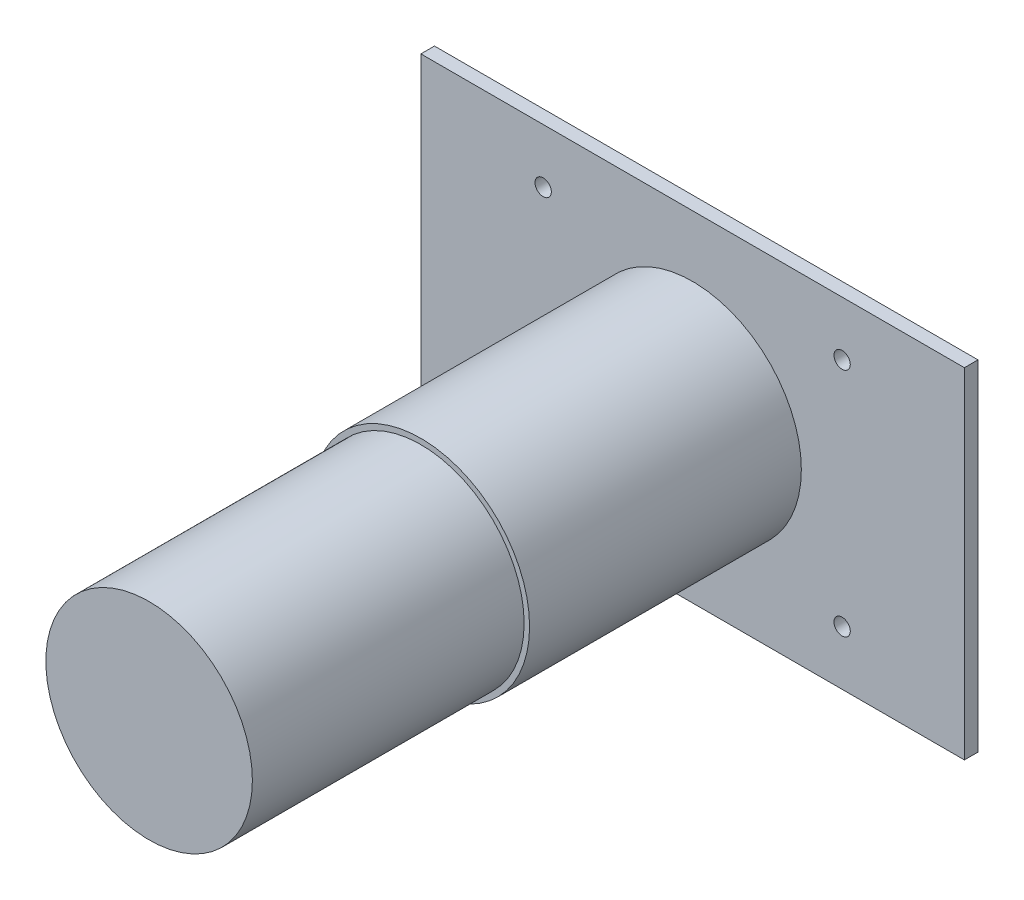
ISO-10303-21;
HEADER;
FILE_DESCRIPTION(('STEP AP214'),'2;1');
FILE_NAME('part.step','',(''),(''),'','','');
FILE_SCHEMA(('AUTOMOTIVE_DESIGN { 1 0 10303 214 1 1 1 1 }'));
ENDSEC;
DATA;
#1=APPLICATION_CONTEXT('core data for automotive mechanical design processes');
#2=APPLICATION_PROTOCOL_DEFINITION('international standard','automotive_design',2000,#1);
#3=PRODUCT_CONTEXT('',#1,'mechanical');
#4=PRODUCT('Part','Part','',(#3));
#5=PRODUCT_RELATED_PRODUCT_CATEGORY('part','',(#4));
#6=PRODUCT_DEFINITION_FORMATION('','',#4);
#7=PRODUCT_DEFINITION_CONTEXT('part definition',#1,'design');
#8=PRODUCT_DEFINITION('design','',#6,#7);
#9=PRODUCT_DEFINITION_SHAPE('','',#8);
#10=(LENGTH_UNIT() NAMED_UNIT(*) SI_UNIT(.MILLI.,.METRE.));
#11=(NAMED_UNIT(*) PLANE_ANGLE_UNIT() SI_UNIT($,.RADIAN.));
#12=(NAMED_UNIT(*) SI_UNIT($,.STERADIAN.) SOLID_ANGLE_UNIT());
#13=UNCERTAINTY_MEASURE_WITH_UNIT(LENGTH_MEASURE(1.E-05),#10,'distance_accuracy_value','');
#14=(GEOMETRIC_REPRESENTATION_CONTEXT(3) GLOBAL_UNCERTAINTY_ASSIGNED_CONTEXT((#13)) GLOBAL_UNIT_ASSIGNED_CONTEXT((#10,
#11,#12)) REPRESENTATION_CONTEXT('',''));
#15=CARTESIAN_POINT('',(0.,0.,0.));
#16=DIRECTION('',(0.,0.,1.));
#17=DIRECTION('',(1.,0.,0.));
#18=AXIS2_PLACEMENT_3D('',#15,#16,#17);
#19=CARTESIAN_POINT('',(-2.64051219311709,-5.7819383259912,205.));
#20=DIRECTION('',(0.,0.,-1.));
#21=DIRECTION('',(-1.,0.,0.));
#22=AXIS2_PLACEMENT_3D('',#19,#20,#21);
#23=CYLINDRICAL_SURFACE('',#22,40.);
#24=CARTESIAN_POINT('',(-2.64051219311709,-5.7819383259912,5.));
#25=DIRECTION('',(0.,0.,1.));
#26=DIRECTION('',(1.,0.,0.));
#27=AXIS2_PLACEMENT_3D('',#24,#25,#26);
#28=CIRCLE('',#27,40.);
#29=CARTESIAN_POINT('',(37.3594878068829,-5.7819383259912,5.));
#30=VERTEX_POINT('',#29);
#31=EDGE_CURVE('E105',#30,#30,#28,.T.);
#32=ORIENTED_EDGE('',*,*,#31,.T.);
#33=EDGE_LOOP('',(#32));
#34=FACE_BOUND('',#33,.T.);
#35=CARTESIAN_POINT('',(-2.64051219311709,-5.7819383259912,105.));
#36=DIRECTION('',(0.,0.,1.));
#37=DIRECTION('',(1.,0.,0.));
#38=AXIS2_PLACEMENT_3D('',#35,#36,#37);
#39=CIRCLE('',#38,40.);
#40=CARTESIAN_POINT('',(37.3594878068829,-5.7819383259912,105.));
#41=VERTEX_POINT('',#40);
#42=EDGE_CURVE('E208',#41,#41,#39,.T.);
#43=ORIENTED_EDGE('',*,*,#42,.F.);
#44=EDGE_LOOP('',(#43));
#45=FACE_BOUND('',#44,.T.);
#46=ADVANCED_FACE('F34',(#34,#45),#23,.T.);
#47=CARTESIAN_POINT('',(-102.640512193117,56.7180616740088,5.));
#48=DIRECTION('',(1.,0.,0.));
#49=DIRECTION('',(0.,0.,-1.));
#50=AXIS2_PLACEMENT_3D('',#47,#48,#49);
#51=PLANE('',#50);
#52=DIRECTION('',(0.,-1.,0.));
#53=VECTOR('',#52,1.);
#54=CARTESIAN_POINT('',(-102.640512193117,56.7180616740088,0.));
#55=LINE('',#54,#53);
#56=CARTESIAN_POINT('',(-102.640512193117,56.7180616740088,0.));
#57=VERTEX_POINT('',#56);
#58=CARTESIAN_POINT('',(-102.640512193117,-68.2819383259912,0.));
#59=VERTEX_POINT('',#58);
#60=EDGE_CURVE('E102',#57,#59,#55,.T.);
#61=ORIENTED_EDGE('',*,*,#60,.T.);
#62=DIRECTION('',(0.,0.,-1.));
#63=VECTOR('',#62,1.);
#64=CARTESIAN_POINT('',(-102.640512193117,-68.2819383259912,5.));
#65=LINE('',#64,#63);
#66=CARTESIAN_POINT('',(-102.640512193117,-68.2819383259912,5.));
#67=VERTEX_POINT('',#66);
#68=EDGE_CURVE('E44',#67,#59,#65,.T.);
#69=ORIENTED_EDGE('',*,*,#68,.F.);
#70=DIRECTION('',(0.,-1.,0.));
#71=VECTOR('',#70,1.);
#72=CARTESIAN_POINT('',(-102.640512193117,56.7180616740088,5.));
#73=LINE('',#72,#71);
#74=CARTESIAN_POINT('',(-102.640512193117,56.7180616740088,5.));
#75=VERTEX_POINT('',#74);
#76=EDGE_CURVE('E88',#75,#67,#73,.T.);
#77=ORIENTED_EDGE('',*,*,#76,.F.);
#78=DIRECTION('',(0.,0.,-1.));
#79=VECTOR('',#78,1.);
#80=CARTESIAN_POINT('',(-102.640512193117,56.7180616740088,5.));
#81=LINE('',#80,#79);
#82=EDGE_CURVE('E98',#75,#57,#81,.T.);
#83=ORIENTED_EDGE('',*,*,#82,.T.);
#84=EDGE_LOOP('',(#61,#69,#77,#83));
#85=FACE_BOUND('',#84,.T.);
#86=ADVANCED_FACE('F36',(#85),#51,.F.);
#87=CARTESIAN_POINT('',(-102.640512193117,-68.2819383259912,5.));
#88=DIRECTION('',(0.,1.,0.));
#89=DIRECTION('',(-1.,0.,0.));
#90=AXIS2_PLACEMENT_3D('',#87,#88,#89);
#91=PLANE('',#90);
#92=DIRECTION('',(1.,0.,0.));
#93=VECTOR('',#92,1.);
#94=CARTESIAN_POINT('',(-102.640512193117,-68.2819383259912,0.));
#95=LINE('',#94,#93);
#96=CARTESIAN_POINT('',(97.3594878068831,-68.2819383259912,0.));
#97=VERTEX_POINT('',#96);
#98=EDGE_CURVE('E93',#59,#97,#95,.T.);
#99=ORIENTED_EDGE('',*,*,#98,.T.);
#100=DIRECTION('',(0.,0.,-1.));
#101=VECTOR('',#100,1.);
#102=CARTESIAN_POINT('',(97.3594878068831,-68.2819383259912,5.));
#103=LINE('',#102,#101);
#104=CARTESIAN_POINT('',(97.3594878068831,-68.2819383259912,5.));
#105=VERTEX_POINT('',#104);
#106=EDGE_CURVE('E91',#105,#97,#103,.T.);
#107=ORIENTED_EDGE('',*,*,#106,.F.);
#108=DIRECTION('',(1.,0.,0.));
#109=VECTOR('',#108,1.);
#110=CARTESIAN_POINT('',(-102.640512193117,-68.2819383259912,5.));
#111=LINE('',#110,#109);
#112=EDGE_CURVE('E83',#67,#105,#111,.T.);
#113=ORIENTED_EDGE('',*,*,#112,.F.);
#114=ORIENTED_EDGE('',*,*,#68,.T.);
#115=EDGE_LOOP('',(#99,#107,#113,#114));
#116=FACE_BOUND('',#115,.T.);
#117=ADVANCED_FACE('F92',(#116),#91,.F.);
#118=CARTESIAN_POINT('',(97.3594878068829,56.7180616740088,5.));
#119=DIRECTION('',(-1.,0.,0.));
#120=DIRECTION('',(0.,-1.,0.));
#121=AXIS2_PLACEMENT_3D('',#118,#119,#120);
#122=PLANE('',#121);
#123=DIRECTION('',(0.,1.,0.));
#124=VECTOR('',#123,1.);
#125=CARTESIAN_POINT('',(97.3594878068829,56.7180616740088,0.));
#126=LINE('',#125,#124);
#127=CARTESIAN_POINT('',(97.3594878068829,56.7180616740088,0.));
#128=VERTEX_POINT('',#127);
#129=EDGE_CURVE('E69',#97,#128,#126,.T.);
#130=ORIENTED_EDGE('',*,*,#129,.T.);
#131=DIRECTION('',(0.,0.,-1.));
#132=VECTOR('',#131,1.);
#133=CARTESIAN_POINT('',(97.3594878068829,56.7180616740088,5.));
#134=LINE('',#133,#132);
#135=CARTESIAN_POINT('',(97.3594878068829,56.7180616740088,5.));
#136=VERTEX_POINT('',#135);
#137=EDGE_CURVE('E94',#136,#128,#134,.T.);
#138=ORIENTED_EDGE('',*,*,#137,.F.);
#139=DIRECTION('',(0.,1.,0.));
#140=VECTOR('',#139,1.);
#141=CARTESIAN_POINT('',(97.3594878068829,56.7180616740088,5.));
#142=LINE('',#141,#140);
#143=EDGE_CURVE('E86',#105,#136,#142,.T.);
#144=ORIENTED_EDGE('',*,*,#143,.F.);
#145=ORIENTED_EDGE('',*,*,#106,.T.);
#146=EDGE_LOOP('',(#130,#138,#144,#145));
#147=FACE_BOUND('',#146,.T.);
#148=ADVANCED_FACE('F96',(#147),#122,.F.);
#149=CARTESIAN_POINT('',(-102.640512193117,56.7180616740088,5.));
#150=DIRECTION('',(0.,-1.,0.));
#151=DIRECTION('',(0.,0.,-1.));
#152=AXIS2_PLACEMENT_3D('',#149,#150,#151);
#153=PLANE('',#152);
#154=DIRECTION('',(-1.,0.,0.));
#155=VECTOR('',#154,1.);
#156=CARTESIAN_POINT('',(-102.640512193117,56.7180616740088,0.));
#157=LINE('',#156,#155);
#158=EDGE_CURVE('E75',#128,#57,#157,.T.);
#159=ORIENTED_EDGE('',*,*,#158,.T.);
#160=ORIENTED_EDGE('',*,*,#82,.F.);
#161=DIRECTION('',(-1.,0.,0.));
#162=VECTOR('',#161,1.);
#163=CARTESIAN_POINT('',(-102.640512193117,56.7180616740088,5.));
#164=LINE('',#163,#162);
#165=EDGE_CURVE('E52',#136,#75,#164,.T.);
#166=ORIENTED_EDGE('',*,*,#165,.F.);
#167=ORIENTED_EDGE('',*,*,#137,.T.);
#168=EDGE_LOOP('',(#159,#160,#166,#167));
#169=FACE_BOUND('',#168,.T.);
#170=ADVANCED_FACE('F125',(#169),#153,.F.);
#171=CARTESIAN_POINT('',(0.,0.,5.));
#172=DIRECTION('',(0.,0.,1.));
#173=DIRECTION('',(1.,0.,0.));
#174=AXIS2_PLACEMENT_3D('',#171,#172,#173);
#175=PLANE('',#174);
#176=CARTESIAN_POINT('',(52.3594878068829,36.7180616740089,5.));
#177=DIRECTION('',(0.,0.,1.));
#178=DIRECTION('',(-1.,0.,0.));
#179=AXIS2_PLACEMENT_3D('',#176,#177,#178);
#180=CIRCLE('',#179,3.);
#181=CARTESIAN_POINT('',(49.3594878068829,36.7180616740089,5.));
#182=VERTEX_POINT('',#181);
#183=EDGE_CURVE('E179',#182,#182,#180,.T.);
#184=ORIENTED_EDGE('',*,*,#183,.F.);
#185=EDGE_LOOP('',(#184));
#186=FACE_BOUND('',#185,.T.);
#187=CARTESIAN_POINT('',(52.359487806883,-48.2819383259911,5.));
#188=DIRECTION('',(0.,0.,-1.));
#189=DIRECTION('',(-1.,0.,0.));
#190=AXIS2_PLACEMENT_3D('',#187,#188,#189);
#191=CIRCLE('',#190,3.);
#192=CARTESIAN_POINT('',(49.359487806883,-48.2819383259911,5.));
#193=VERTEX_POINT('',#192);
#194=EDGE_CURVE('E181',#193,#193,#191,.T.);
#195=ORIENTED_EDGE('',*,*,#194,.T.);
#196=EDGE_LOOP('',(#195));
#197=FACE_BOUND('',#196,.T.);
#198=CARTESIAN_POINT('',(-57.6405121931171,36.7180616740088,5.));
#199=DIRECTION('',(0.,0.,-1.));
#200=DIRECTION('',(1.,0.,0.));
#201=AXIS2_PLACEMENT_3D('',#198,#199,#200);
#202=CIRCLE('',#201,3.);
#203=CARTESIAN_POINT('',(-54.6405121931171,36.7180616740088,5.));
#204=VERTEX_POINT('',#203);
#205=EDGE_CURVE('E187',#204,#204,#202,.T.);
#206=ORIENTED_EDGE('',*,*,#205,.T.);
#207=EDGE_LOOP('',(#206));
#208=FACE_BOUND('',#207,.T.);
#209=CARTESIAN_POINT('',(-57.6405121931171,-48.2819383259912,5.));
#210=DIRECTION('',(0.,0.,1.));
#211=DIRECTION('',(1.,0.,0.));
#212=AXIS2_PLACEMENT_3D('',#209,#210,#211);
#213=CIRCLE('',#212,3.);
#214=CARTESIAN_POINT('',(-54.6405121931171,-48.2819383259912,5.));
#215=VERTEX_POINT('',#214);
#216=EDGE_CURVE('E193',#215,#215,#213,.T.);
#217=ORIENTED_EDGE('',*,*,#216,.F.);
#218=EDGE_LOOP('',(#217));
#219=FACE_BOUND('',#218,.T.);
#220=ORIENTED_EDGE('',*,*,#31,.F.);
#221=EDGE_LOOP('',(#220));
#222=FACE_BOUND('',#221,.T.);
#223=ORIENTED_EDGE('',*,*,#76,.T.);
#224=ORIENTED_EDGE('',*,*,#112,.T.);
#225=ORIENTED_EDGE('',*,*,#143,.T.);
#226=ORIENTED_EDGE('',*,*,#165,.T.);
#227=EDGE_LOOP('',(#223,#224,#225,#226));
#228=FACE_BOUND('',#227,.T.);
#229=ADVANCED_FACE('F84',(#186,#197,#208,#219,#222,#228),#175,.T.);
#230=CARTESIAN_POINT('',(0.,0.,0.));
#231=DIRECTION('',(0.,0.,1.));
#232=DIRECTION('',(1.,0.,0.));
#233=AXIS2_PLACEMENT_3D('',#230,#231,#232);
#234=PLANE('',#233);
#235=CARTESIAN_POINT('',(52.3594878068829,36.7180616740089,0.));
#236=DIRECTION('',(0.,0.,1.));
#237=DIRECTION('',(-1.,0.,0.));
#238=AXIS2_PLACEMENT_3D('',#235,#236,#237);
#239=CIRCLE('',#238,3.);
#240=CARTESIAN_POINT('',(49.3594878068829,36.7180616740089,0.));
#241=VERTEX_POINT('',#240);
#242=EDGE_CURVE('E176',#241,#241,#239,.T.);
#243=ORIENTED_EDGE('',*,*,#242,.T.);
#244=EDGE_LOOP('',(#243));
#245=FACE_BOUND('',#244,.T.);
#246=CARTESIAN_POINT('',(52.359487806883,-48.2819383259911,0.));
#247=DIRECTION('',(0.,0.,-1.));
#248=DIRECTION('',(-1.,0.,0.));
#249=AXIS2_PLACEMENT_3D('',#246,#247,#248);
#250=CIRCLE('',#249,3.);
#251=CARTESIAN_POINT('',(49.359487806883,-48.2819383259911,0.));
#252=VERTEX_POINT('',#251);
#253=EDGE_CURVE('E184',#252,#252,#250,.T.);
#254=ORIENTED_EDGE('',*,*,#253,.F.);
#255=EDGE_LOOP('',(#254));
#256=FACE_BOUND('',#255,.T.);
#257=CARTESIAN_POINT('',(-57.6405121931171,36.7180616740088,0.));
#258=DIRECTION('',(0.,0.,-1.));
#259=DIRECTION('',(1.,0.,0.));
#260=AXIS2_PLACEMENT_3D('',#257,#258,#259);
#261=CIRCLE('',#260,3.);
#262=CARTESIAN_POINT('',(-54.6405121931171,36.7180616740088,0.));
#263=VERTEX_POINT('',#262);
#264=EDGE_CURVE('E190',#263,#263,#261,.T.);
#265=ORIENTED_EDGE('',*,*,#264,.F.);
#266=EDGE_LOOP('',(#265));
#267=FACE_BOUND('',#266,.T.);
#268=CARTESIAN_POINT('',(-57.6405121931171,-48.2819383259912,0.));
#269=DIRECTION('',(0.,0.,1.));
#270=DIRECTION('',(1.,0.,0.));
#271=AXIS2_PLACEMENT_3D('',#268,#269,#270);
#272=CIRCLE('',#271,3.);
#273=CARTESIAN_POINT('',(-54.6405121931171,-48.2819383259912,0.));
#274=VERTEX_POINT('',#273);
#275=EDGE_CURVE('E196',#274,#274,#272,.T.);
#276=ORIENTED_EDGE('',*,*,#275,.T.);
#277=EDGE_LOOP('',(#276));
#278=FACE_BOUND('',#277,.T.);
#279=ORIENTED_EDGE('',*,*,#60,.F.);
#280=ORIENTED_EDGE('',*,*,#158,.F.);
#281=ORIENTED_EDGE('',*,*,#129,.F.);
#282=ORIENTED_EDGE('',*,*,#98,.F.);
#283=EDGE_LOOP('',(#279,#280,#281,#282));
#284=FACE_BOUND('',#283,.T.);
#285=ADVANCED_FACE('F113',(#245,#256,#267,#278,#284),#234,.F.);
#286=CARTESIAN_POINT('',(-2.64051219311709,-5.7819383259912,105.));
#287=DIRECTION('',(0.,0.,1.));
#288=DIRECTION('',(1.,0.,0.));
#289=AXIS2_PLACEMENT_3D('',#286,#287,#288);
#290=PLANE('',#289);
#291=CARTESIAN_POINT('',(-2.64051219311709,-5.7819383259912,105.));
#292=DIRECTION('',(0.,0.,1.));
#293=DIRECTION('',(1.,0.,0.));
#294=AXIS2_PLACEMENT_3D('',#291,#292,#293);
#295=CIRCLE('',#294,38.);
#296=CARTESIAN_POINT('',(35.3594878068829,-5.7819383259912,105.));
#297=VERTEX_POINT('',#296);
#298=EDGE_CURVE('E205',#297,#297,#295,.T.);
#299=ORIENTED_EDGE('',*,*,#298,.F.);
#300=EDGE_LOOP('',(#299));
#301=FACE_BOUND('',#300,.T.);
#302=ORIENTED_EDGE('',*,*,#42,.T.);
#303=EDGE_LOOP('',(#302));
#304=FACE_BOUND('',#303,.T.);
#305=ADVANCED_FACE('F115',(#301,#304),#290,.T.);
#306=CARTESIAN_POINT('',(-2.64051219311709,-5.7819383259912,105.));
#307=DIRECTION('',(0.,0.,1.));
#308=DIRECTION('',(1.,0.,0.));
#309=AXIS2_PLACEMENT_3D('',#306,#307,#308);
#310=CYLINDRICAL_SURFACE('',#309,38.);
#311=ORIENTED_EDGE('',*,*,#298,.T.);
#312=EDGE_LOOP('',(#311));
#313=FACE_BOUND('',#312,.T.);
#314=CARTESIAN_POINT('',(-2.64051219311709,-5.7819383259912,205.));
#315=DIRECTION('',(0.,0.,1.));
#316=DIRECTION('',(1.,0.,0.));
#317=AXIS2_PLACEMENT_3D('',#314,#315,#316);
#318=CIRCLE('',#317,38.);
#319=CARTESIAN_POINT('',(35.3594878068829,-5.7819383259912,205.));
#320=VERTEX_POINT('',#319);
#321=EDGE_CURVE('E204',#320,#320,#318,.T.);
#322=ORIENTED_EDGE('',*,*,#321,.F.);
#323=EDGE_LOOP('',(#322));
#324=FACE_BOUND('',#323,.T.);
#325=ADVANCED_FACE('F122',(#313,#324),#310,.T.);
#326=CARTESIAN_POINT('',(-2.64051219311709,-5.7819383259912,205.));
#327=DIRECTION('',(0.,0.,1.));
#328=DIRECTION('',(1.,0.,0.));
#329=AXIS2_PLACEMENT_3D('',#326,#327,#328);
#330=PLANE('',#329);
#331=ORIENTED_EDGE('',*,*,#321,.T.);
#332=EDGE_LOOP('',(#331));
#333=FACE_BOUND('',#332,.T.);
#334=ADVANCED_FACE('F141',(#333),#330,.T.);
#335=CARTESIAN_POINT('',(-57.6405121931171,-48.2819383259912,0.));
#336=DIRECTION('',(0.,0.,1.));
#337=DIRECTION('',(1.,0.,0.));
#338=AXIS2_PLACEMENT_3D('',#335,#336,#337);
#339=CYLINDRICAL_SURFACE('',#338,3.);
#340=ORIENTED_EDGE('',*,*,#275,.F.);
#341=EDGE_LOOP('',(#340));
#342=FACE_BOUND('',#341,.T.);
#343=ORIENTED_EDGE('',*,*,#216,.T.);
#344=EDGE_LOOP('',(#343));
#345=FACE_BOUND('',#344,.T.);
#346=ADVANCED_FACE('F144',(#342,#345),#339,.F.);
#347=CARTESIAN_POINT('',(-57.6405121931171,36.7180616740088,0.));
#348=DIRECTION('',(0.,0.,1.));
#349=DIRECTION('',(1.,0.,0.));
#350=AXIS2_PLACEMENT_3D('',#347,#348,#349);
#351=CYLINDRICAL_SURFACE('',#350,3.);
#352=ORIENTED_EDGE('',*,*,#264,.T.);
#353=EDGE_LOOP('',(#352));
#354=FACE_BOUND('',#353,.T.);
#355=ORIENTED_EDGE('',*,*,#205,.F.);
#356=EDGE_LOOP('',(#355));
#357=FACE_BOUND('',#356,.T.);
#358=ADVANCED_FACE('F160',(#354,#357),#351,.F.);
#359=CARTESIAN_POINT('',(52.359487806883,-48.2819383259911,0.));
#360=DIRECTION('',(0.,0.,1.));
#361=DIRECTION('',(1.,0.,0.));
#362=AXIS2_PLACEMENT_3D('',#359,#360,#361);
#363=CYLINDRICAL_SURFACE('',#362,3.);
#364=ORIENTED_EDGE('',*,*,#253,.T.);
#365=EDGE_LOOP('',(#364));
#366=FACE_BOUND('',#365,.T.);
#367=ORIENTED_EDGE('',*,*,#194,.F.);
#368=EDGE_LOOP('',(#367));
#369=FACE_BOUND('',#368,.T.);
#370=ADVANCED_FACE('F164',(#366,#369),#363,.F.);
#371=CARTESIAN_POINT('',(52.3594878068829,36.7180616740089,0.));
#372=DIRECTION('',(0.,0.,1.));
#373=DIRECTION('',(1.,0.,0.));
#374=AXIS2_PLACEMENT_3D('',#371,#372,#373);
#375=CYLINDRICAL_SURFACE('',#374,3.);
#376=ORIENTED_EDGE('',*,*,#242,.F.);
#377=EDGE_LOOP('',(#376));
#378=FACE_BOUND('',#377,.T.);
#379=ORIENTED_EDGE('',*,*,#183,.T.);
#380=EDGE_LOOP('',(#379));
#381=FACE_BOUND('',#380,.T.);
#382=ADVANCED_FACE('F168',(#378,#381),#375,.F.);
#383=CLOSED_SHELL('',(#46,#86,#117,#148,#170,#229,#285,#305,#325,#334,#346,#358,#370,#382));
#384=CARTESIAN_POINT('',(-2.64051219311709,-5.7819383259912,200.));
#385=DIRECTION('',(0.,0.,1.));
#386=DIRECTION('',(1.,0.,0.));
#387=AXIS2_PLACEMENT_3D('',#384,#385,#386);
#388=PLANE('',#387);
#389=CARTESIAN_POINT('',(-2.64051219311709,-5.7819383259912,200.));
#390=DIRECTION('',(0.,0.,1.));
#391=DIRECTION('',(1.,0.,0.));
#392=AXIS2_PLACEMENT_3D('',#389,#390,#391);
#393=CIRCLE('',#392,36.);
#394=CARTESIAN_POINT('',(33.3594878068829,-5.7819383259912,200.));
#395=VERTEX_POINT('',#394);
#396=EDGE_CURVE('E199',#395,#395,#393,.T.);
#397=ORIENTED_EDGE('',*,*,#396,.F.);
#398=EDGE_LOOP('',(#397));
#399=FACE_BOUND('',#398,.T.);
#400=ADVANCED_FACE('F154',(#399),#388,.F.);
#401=CARTESIAN_POINT('',(-2.64051219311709,-5.7819383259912,5.));
#402=DIRECTION('',(0.,0.,1.));
#403=DIRECTION('',(1.,0.,0.));
#404=AXIS2_PLACEMENT_3D('',#401,#402,#403);
#405=CIRCLE('',#404,36.);
#406=CARTESIAN_POINT('',(33.3594878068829,-5.7819383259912,5.));
#407=VERTEX_POINT('',#406);
#408=EDGE_CURVE('E11',#407,#407,#405,.F.);
#409=ORIENTED_EDGE('',*,*,#408,.F.);
#410=EDGE_LOOP('',(#409));
#411=FACE_BOUND('',#410,.T.);
#412=ADVANCED_FACE('F128',(#411),#175,.T.);
#413=CARTESIAN_POINT('',(-2.64051219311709,-5.7819383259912,205.));
#414=DIRECTION('',(0.,0.,-1.));
#415=DIRECTION('',(-1.,0.,0.));
#416=AXIS2_PLACEMENT_3D('',#413,#414,#415);
#417=CYLINDRICAL_SURFACE('',#416,36.);
#418=ORIENTED_EDGE('',*,*,#408,.T.);
#419=EDGE_LOOP('',(#418));
#420=FACE_BOUND('',#419,.T.);
#421=ORIENTED_EDGE('',*,*,#396,.T.);
#422=EDGE_LOOP('',(#421));
#423=FACE_BOUND('',#422,.T.);
#424=ADVANCED_FACE('F146',(#420,#423),#417,.F.);
#425=CLOSED_SHELL('',(#400,#412,#424));
#426=ORIENTED_CLOSED_SHELL('',*,#425,.T.);
#427=BREP_WITH_VOIDS('B2',#383,(#426));
#428=ADVANCED_BREP_SHAPE_REPRESENTATION('',(#18,#427),#14);
#429=SHAPE_DEFINITION_REPRESENTATION(#9,#428);
ENDSEC;
END-ISO-10303-21;
